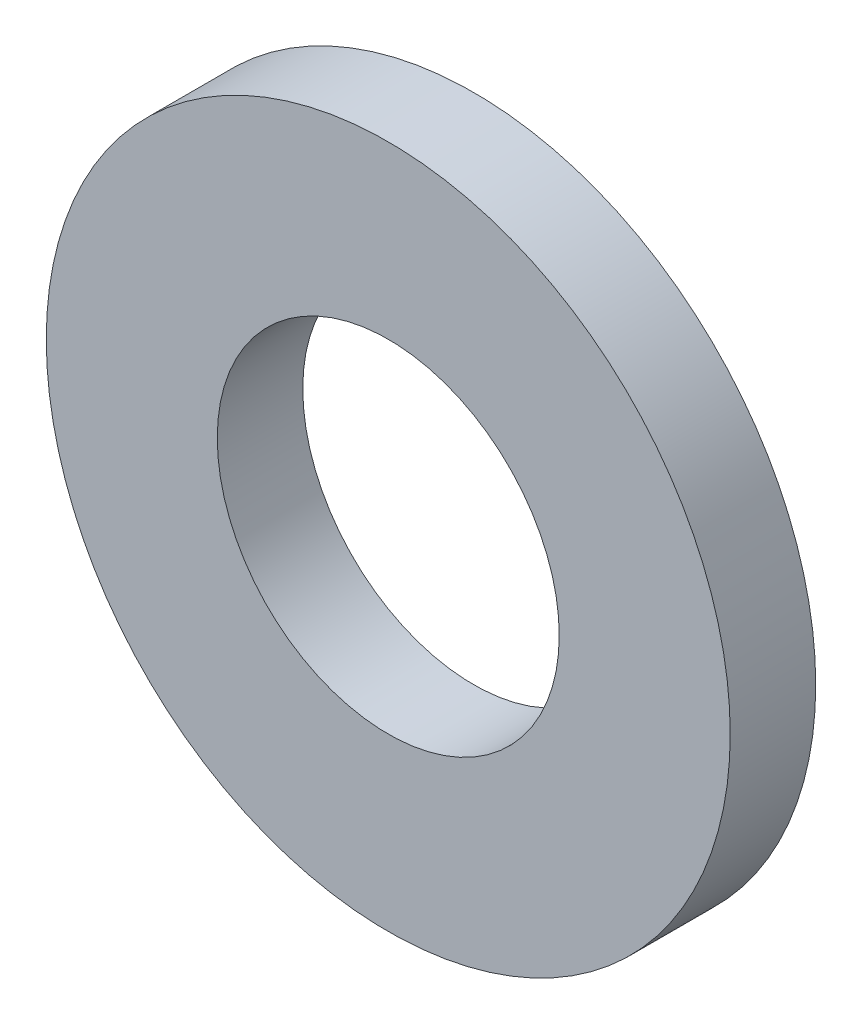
from build123d import *

# Parameters (mm, degrees)
SKETCH1_R           = 8
SKETCH1_R_2         = 4
BOSS_EXTRUDE1_DEPTH = 2


with BuildPart() as part:
    # Sketch1 → Boss-Extrude1 (new body)
    with BuildSketch(Plane.XY):
        Circle(SKETCH1_R)
        Circle(SKETCH1_R_2, mode=Mode.SUBTRACT)
    extrude(amount=BOSS_EXTRUDE1_DEPTH)


solid = part.part
